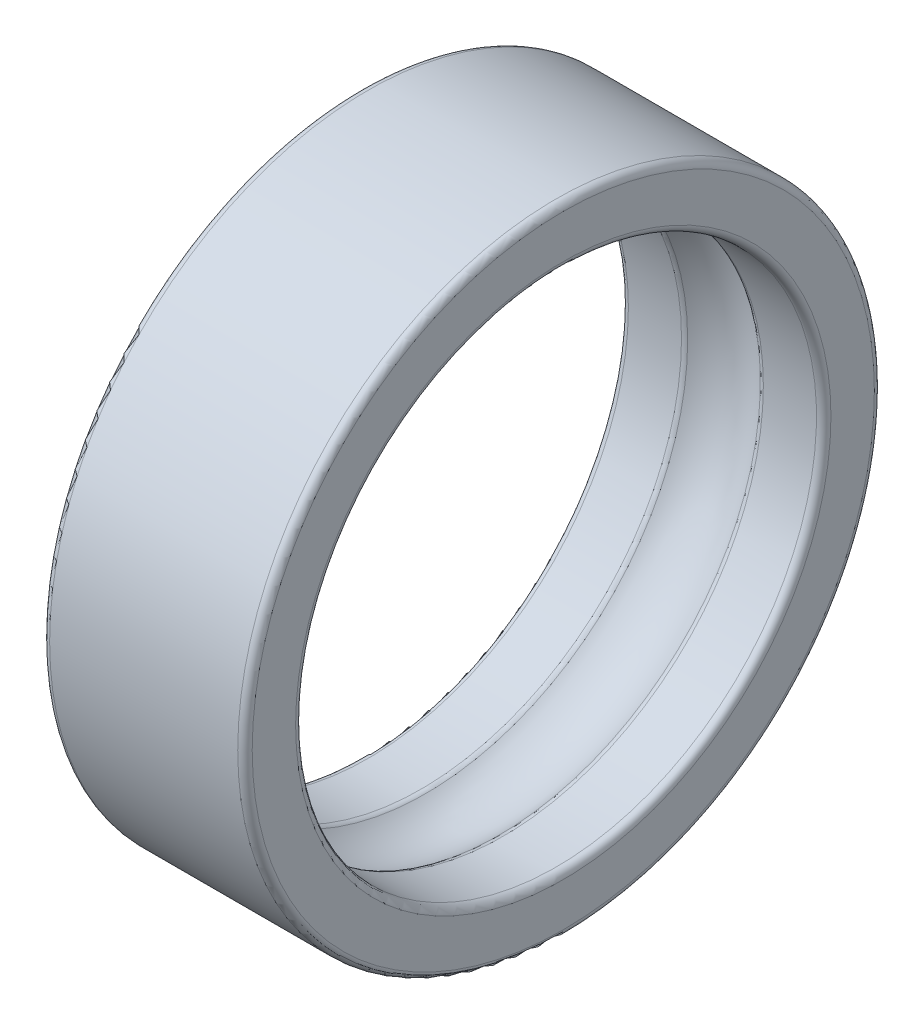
from build123d import *

# Parameters (mm, degrees)
CONG_1_R = 0.25


with BuildPart() as part:
    # Esquisse1 → R_volution1 (revolve)
    with BuildSketch(Plane.XY, mode=Mode.PRIVATE) as r_volution1_sk:
        with BuildLine():
            Line((1.322875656, 9), (3.5, 9))
            Line((3.5, 9), (3.5, 11))
            Line((3.5, 11), (-3.5, 11))
            Line((-3.5, 11), (-3.5, 9))
            Line((-3.5, 9), (-1.322875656, 9))
            ThreePointArc((-1.322875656, 9), (0, 9.5), (1.322875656, 9))
        make_face()
    revolve(r_volution1_sk.sketch.rotate(Axis((-31.667666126, 0, 0), (1, 0, 0)), 90), axis=Axis((-31.667666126, 0, 0), (1, 0, 0)))

    # Cong_1
    cong_1_edges = [part.edges().sort_by_distance(p)[0] for p in [
        (1.322875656, 0, -9),
        (3.5, 0, -9),
        (3.5, 0, -11),
        (-3.5, 0, -11),
        (-3.5, 0, -9),
        (-1.322875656, 0, -9),
    ]]
    fillet(cong_1_edges, radius=CONG_1_R)


solid = part.part
